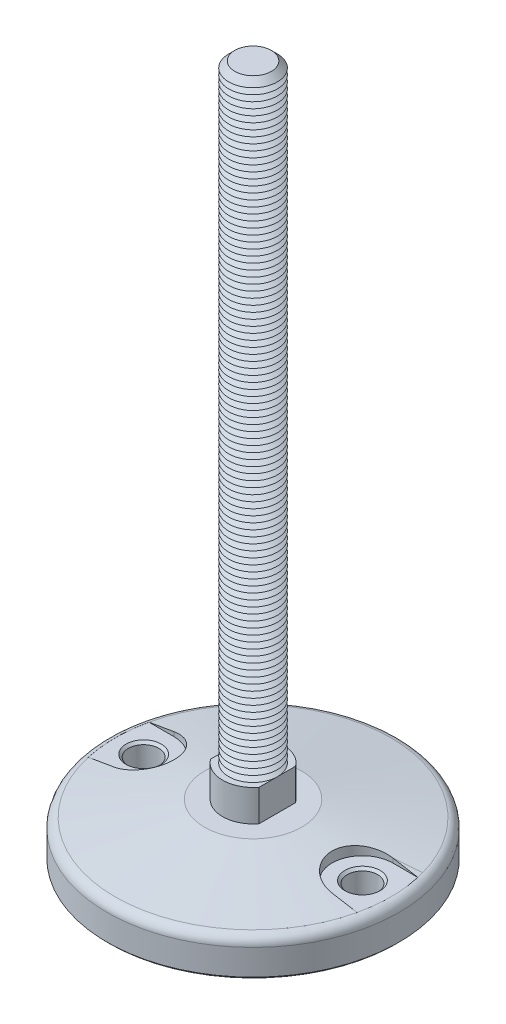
from build123d import *

# Parameters (mm, degrees)
FILLET1_R                = 4
SKETCH3_R                = 12.5
BOSS_EXTRUDE1_DEPTH      = 13
CUT_EXTRUDE1_START       = -13
CUT_EXTRUDE1_DEPTH       = 13
SKETCH5_R                = 10
BOSS_EXTRUDE2_DEPTH      = 250
CHAMFER1_SIZE            = 2.5
LPATTERN1_COUNT          = 99
LPATTERN1_PITCH          = 2.5
CUT_EXTRUDE4_DEPTH       = 6.5
SKETCH10_R               = 6.25
CUT_EXTRUDE5_DEPTH       = 15.5
CHAMFER2_SIZE            = 1
CHAMFER2_OF_MIRROR1_SIZE = 1
CHAMFER3_SIZE            = 1


with BuildPart() as part:
    # Sketch2 → Revolve1 (revolve)
    with BuildSketch(Plane(origin=(0, 0, 0), x_dir=(0, 0, -1), z_dir=(1, 0, 0)), mode=Mode.PRIVATE) as revolve1_sk:
        Polygon((0, 0), (-20, 0), (-60, -7.053079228), (-60, -22), (0, -22), align=None)
    revolve(revolve1_sk.sketch.rotate(Axis((0, 61.338865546, 0), (0, -1, 0)), 180), axis=Axis((0, 61.338865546, 0), (0, -1, 0)))

    # Fillet1
    fillet1_edges = [part.edges().sort_by_distance(p)[0] for p in [
        (0, -7.053079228, 60),
    ]]
    fillet(fillet1_edges, radius=FILLET1_R)

    # Sketch3 → Boss-Extrude1 (add)
    with BuildSketch(Plane(origin=(0, 0, 0), x_dir=(1, 0, 0), z_dir=(0, 1, 0))):
        with Locations(Location((0, 0, 0), (0, 0, 90))):
            Circle(SKETCH3_R)
    extrude(amount=BOSS_EXTRUDE1_DEPTH)

    # Sketch4 → Cut-Extrude1 (cut)
    with BuildSketch(Plane(origin=(0, 13, 0), x_dir=(1, 0, 0), z_dir=(0, 1, 0)).offset(CUT_EXTRUDE1_START)):
        with BuildLine():
            Line((-10, 7.5), (-10, -7.5))
            ThreePointArc((-10, -7.5), (-12.5, 0), (-10, 7.5))
        make_face()
        with BuildLine():
            Line((10, -7.5), (10, 7.5))
            ThreePointArc((10, 7.5), (12.5, 0), (10, -7.5))
        make_face()
    extrude(amount=CUT_EXTRUDE1_DEPTH, mode=Mode.SUBTRACT)

    # Sketch5 → Boss-Extrude2 (add)
    with BuildSketch(Plane(origin=(0, 13, 0), x_dir=(1, 0, 0), z_dir=(0, 1, 0))):
        with Locations(Location((0, 0, 0), (0, 0, 180))):
            Circle(SKETCH5_R)
    extrude(amount=BOSS_EXTRUDE2_DEPTH)

    # Chamfer1
    chamfer1_edges = [part.edges().sort_by_distance(p)[0] for p in [
        (10, 263, 0),
    ]]
    chamfer(chamfer1_edges, length=CHAMFER1_SIZE)

    # Sketch6 → Cut-Revolve1 (revolve, cut)
    with BuildSketch(Plane(origin=(0, 0, 0), x_dir=(0, 0, -1), z_dir=(1, 0, 0))):
        Polygon((-10, 13), (-7.834936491, 14.25), (-10, 15.5), align=None)
    cut_revolve1 = revolve(axis=Axis((0, 61.338865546, 0), (0, -1, 0)), mode=Mode.SUBTRACT)

    # LPattern1: Cut-Revolve1 ×99
    with Locations(*[(0, i * LPATTERN1_PITCH, 0) for i in range(1, LPATTERN1_COUNT)]):
        add(cut_revolve1, mode=Mode.SUBTRACT)

    # Sketch8 → Cut-Extrude4 (cut)
    with BuildSketch(Plane(origin=(0, 0, 0), x_dir=(1, 0, 0), z_dir=(0, 1, 0))):
        with BuildLine():
            Line((-45, 12.5), (-55.299428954, 12.5))
            ThreePointArc((-55.299428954, 12.5), (-56.694592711, 0), (-55.299428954, -12.5))
            Line((-55.299428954, -12.5), (-45, -12.5))
            ThreePointArc((-45, -12.5), (-32.5, 0), (-45, 12.5))
        make_face()
    cut_extrude4 = extrude(amount=-CUT_EXTRUDE4_DEPTH, mode=Mode.SUBTRACT)

    # Sketch10 → Cut-Extrude5 (cut)
    with BuildSketch(Plane(origin=(0, -6.5, 0), x_dir=(1, 0, 0), z_dir=(0, 1, 0))):
        with Locations(Location((-45, 0, 0), (0, 0, 270))):
            Circle(SKETCH10_R)
    cut_extrude5 = extrude(amount=-CUT_EXTRUDE5_DEPTH, mode=Mode.SUBTRACT)

    # Chamfer2
    chamfer2_edges = [part.edges().sort_by_distance(p)[0] for p in [
        (-45, -6.5, -6.25),
        (-45, -22, -6.25),
    ]]
    chamfer(chamfer2_edges, length=CHAMFER2_SIZE)

    # Mirror1: Cut-Extrude4, Cut-Extrude5 across plane
    add(cut_extrude4.mirror(Plane(origin=(0, 0, 0), x_dir=(0, 0, 1), z_dir=(1, 0, 0))), mode=Mode.SUBTRACT)
    add(cut_extrude5.mirror(Plane(origin=(0, 0, 0), x_dir=(0, 0, 1), z_dir=(1, 0, 0))), mode=Mode.SUBTRACT)

    # Chamfer2 of Mirror1
    chamfer2_of_mirror1_edges = [part.edges().sort_by_distance(p)[0] for p in [
        (45, -6.5, -6.25),
        (45, -22, -6.25),
    ]]
    chamfer(chamfer2_of_mirror1_edges, length=CHAMFER2_OF_MIRROR1_SIZE)

    # Chamfer3
    chamfer3_edges = [part.edges().sort_by_distance(p)[0] for p in [
        (0, -22, 60),
    ]]
    chamfer(chamfer3_edges, length=CHAMFER3_SIZE)


solid = part.part
